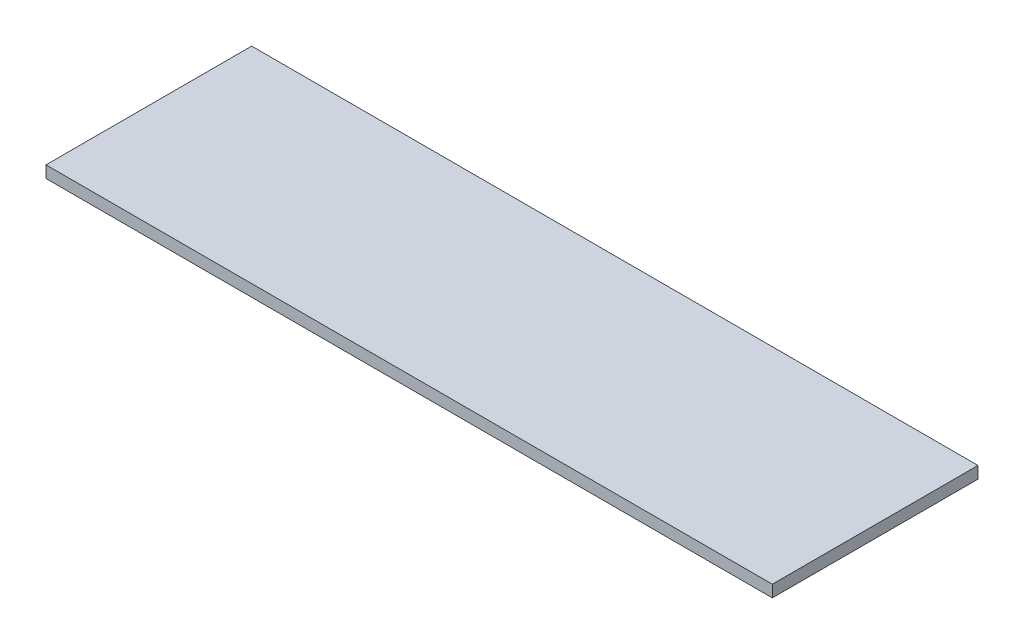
ISO-10303-21;
HEADER;
FILE_DESCRIPTION(('STEP AP214'),'2;1');
FILE_NAME('part.step','',(''),(''),'','','');
FILE_SCHEMA(('AUTOMOTIVE_DESIGN { 1 0 10303 214 1 1 1 1 }'));
ENDSEC;
DATA;
#1=APPLICATION_CONTEXT('core data for automotive mechanical design processes');
#2=APPLICATION_PROTOCOL_DEFINITION('international standard','automotive_design',2000,#1);
#3=PRODUCT_CONTEXT('',#1,'mechanical');
#4=PRODUCT('Part','Part','',(#3));
#5=PRODUCT_RELATED_PRODUCT_CATEGORY('part','',(#4));
#6=PRODUCT_DEFINITION_FORMATION('','',#4);
#7=PRODUCT_DEFINITION_CONTEXT('part definition',#1,'design');
#8=PRODUCT_DEFINITION('design','',#6,#7);
#9=PRODUCT_DEFINITION_SHAPE('','',#8);
#10=(LENGTH_UNIT() NAMED_UNIT(*) SI_UNIT(.MILLI.,.METRE.));
#11=(NAMED_UNIT(*) PLANE_ANGLE_UNIT() SI_UNIT($,.RADIAN.));
#12=(NAMED_UNIT(*) SI_UNIT($,.STERADIAN.) SOLID_ANGLE_UNIT());
#13=UNCERTAINTY_MEASURE_WITH_UNIT(LENGTH_MEASURE(1.E-05),#10,'distance_accuracy_value','');
#14=(GEOMETRIC_REPRESENTATION_CONTEXT(3) GLOBAL_UNCERTAINTY_ASSIGNED_CONTEXT((#13)) GLOBAL_UNIT_ASSIGNED_CONTEXT((#10,
#11,#12)) REPRESENTATION_CONTEXT('',''));
#15=CARTESIAN_POINT('',(0.,0.,0.));
#16=DIRECTION('',(0.,0.,1.));
#17=DIRECTION('',(1.,0.,0.));
#18=AXIS2_PLACEMENT_3D('',#15,#16,#17);
#19=CARTESIAN_POINT('',(111.610966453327,94.,63.5));
#20=DIRECTION('',(-1.,0.,0.));
#21=DIRECTION('',(0.,0.,1.));
#22=AXIS2_PLACEMENT_3D('',#19,#20,#21);
#23=PLANE('',#22);
#24=DIRECTION('',(0.,0.,1.));
#25=VECTOR('',#24,1.);
#26=CARTESIAN_POINT('',(111.610966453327,97.,63.5));
#27=LINE('',#26,#25);
#28=CARTESIAN_POINT('',(111.610966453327,97.,63.5));
#29=VERTEX_POINT('',#28);
#30=CARTESIAN_POINT('',(111.610966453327,97.,115.5));
#31=VERTEX_POINT('',#30);
#32=EDGE_CURVE('E87',#29,#31,#27,.T.);
#33=ORIENTED_EDGE('',*,*,#32,.T.);
#34=DIRECTION('',(0.,1.,0.));
#35=VECTOR('',#34,1.);
#36=CARTESIAN_POINT('',(111.610966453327,94.,115.5));
#37=LINE('',#36,#35);
#38=CARTESIAN_POINT('',(111.610966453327,94.,115.5));
#39=VERTEX_POINT('',#38);
#40=EDGE_CURVE('E41',#39,#31,#37,.T.);
#41=ORIENTED_EDGE('',*,*,#40,.F.);
#42=DIRECTION('',(0.,0.,1.));
#43=VECTOR('',#42,1.);
#44=CARTESIAN_POINT('',(111.610966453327,94.,63.5));
#45=LINE('',#44,#43);
#46=CARTESIAN_POINT('',(111.610966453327,94.,63.5));
#47=VERTEX_POINT('',#46);
#48=EDGE_CURVE('E81',#47,#39,#45,.T.);
#49=ORIENTED_EDGE('',*,*,#48,.F.);
#50=DIRECTION('',(0.,1.,0.));
#51=VECTOR('',#50,1.);
#52=CARTESIAN_POINT('',(111.610966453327,94.,63.5));
#53=LINE('',#52,#51);
#54=EDGE_CURVE('E11',#47,#29,#53,.T.);
#55=ORIENTED_EDGE('',*,*,#54,.T.);
#56=EDGE_LOOP('',(#33,#41,#49,#55));
#57=FACE_BOUND('',#56,.T.);
#58=ADVANCED_FACE('F33',(#57),#23,.F.);
#59=CARTESIAN_POINT('',(111.610966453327,94.,115.5));
#60=DIRECTION('',(0.,0.,-1.));
#61=DIRECTION('',(-1.,0.,0.));
#62=AXIS2_PLACEMENT_3D('',#59,#60,#61);
#63=PLANE('',#62);
#64=DIRECTION('',(-1.,0.,0.));
#65=VECTOR('',#64,1.);
#66=CARTESIAN_POINT('',(111.610966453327,97.,115.5));
#67=LINE('',#66,#65);
#68=CARTESIAN_POINT('',(-72.0156283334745,97.,115.5));
#69=VERTEX_POINT('',#68);
#70=EDGE_CURVE('E67',#31,#69,#67,.T.);
#71=ORIENTED_EDGE('',*,*,#70,.T.);
#72=DIRECTION('',(0.,1.,0.));
#73=VECTOR('',#72,1.);
#74=CARTESIAN_POINT('',(-72.0156283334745,94.,115.5));
#75=LINE('',#74,#73);
#76=CARTESIAN_POINT('',(-72.0156283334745,94.,115.5));
#77=VERTEX_POINT('',#76);
#78=EDGE_CURVE('E88',#77,#69,#75,.T.);
#79=ORIENTED_EDGE('',*,*,#78,.F.);
#80=DIRECTION('',(-1.,0.,0.));
#81=VECTOR('',#80,1.);
#82=CARTESIAN_POINT('',(111.610966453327,94.,115.5));
#83=LINE('',#82,#81);
#84=EDGE_CURVE('E85',#39,#77,#83,.T.);
#85=ORIENTED_EDGE('',*,*,#84,.F.);
#86=ORIENTED_EDGE('',*,*,#40,.T.);
#87=EDGE_LOOP('',(#71,#79,#85,#86));
#88=FACE_BOUND('',#87,.T.);
#89=ADVANCED_FACE('F89',(#88),#63,.F.);
#90=CARTESIAN_POINT('',(-72.0156283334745,94.,63.5));
#91=DIRECTION('',(1.,0.,0.));
#92=DIRECTION('',(0.,0.,-1.));
#93=AXIS2_PLACEMENT_3D('',#90,#91,#92);
#94=PLANE('',#93);
#95=DIRECTION('',(0.,0.,-1.));
#96=VECTOR('',#95,1.);
#97=CARTESIAN_POINT('',(-72.0156283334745,97.,63.5));
#98=LINE('',#97,#96);
#99=CARTESIAN_POINT('',(-72.0156283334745,97.,63.5));
#100=VERTEX_POINT('',#99);
#101=EDGE_CURVE('E99',#69,#100,#98,.T.);
#102=ORIENTED_EDGE('',*,*,#101,.T.);
#103=DIRECTION('',(0.,1.,0.));
#104=VECTOR('',#103,1.);
#105=CARTESIAN_POINT('',(-72.0156283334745,94.,63.5));
#106=LINE('',#105,#104);
#107=CARTESIAN_POINT('',(-72.0156283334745,94.,63.5));
#108=VERTEX_POINT('',#107);
#109=EDGE_CURVE('E93',#108,#100,#106,.T.);
#110=ORIENTED_EDGE('',*,*,#109,.F.);
#111=DIRECTION('',(0.,0.,-1.));
#112=VECTOR('',#111,1.);
#113=CARTESIAN_POINT('',(-72.0156283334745,94.,63.5));
#114=LINE('',#113,#112);
#115=EDGE_CURVE('E91',#77,#108,#114,.T.);
#116=ORIENTED_EDGE('',*,*,#115,.F.);
#117=ORIENTED_EDGE('',*,*,#78,.T.);
#118=EDGE_LOOP('',(#102,#110,#116,#117));
#119=FACE_BOUND('',#118,.T.);
#120=ADVANCED_FACE('F104',(#119),#94,.F.);
#121=CARTESIAN_POINT('',(97.5,94.,63.5));
#122=DIRECTION('',(0.,0.,1.));
#123=DIRECTION('',(1.,0.,0.));
#124=AXIS2_PLACEMENT_3D('',#121,#122,#123);
#125=PLANE('',#124);
#126=DIRECTION('',(1.,0.,0.));
#127=VECTOR('',#126,1.);
#128=CARTESIAN_POINT('',(97.5,97.,63.5));
#129=LINE('',#128,#127);
#130=EDGE_CURVE('E74',#100,#29,#129,.T.);
#131=ORIENTED_EDGE('',*,*,#130,.T.);
#132=ORIENTED_EDGE('',*,*,#54,.F.);
#133=DIRECTION('',(1.,0.,0.));
#134=VECTOR('',#133,1.);
#135=CARTESIAN_POINT('',(97.5,94.,63.5));
#136=LINE('',#135,#134);
#137=EDGE_CURVE('E49',#108,#47,#136,.T.);
#138=ORIENTED_EDGE('',*,*,#137,.F.);
#139=ORIENTED_EDGE('',*,*,#109,.T.);
#140=EDGE_LOOP('',(#131,#132,#138,#139));
#141=FACE_BOUND('',#140,.T.);
#142=ADVANCED_FACE('F107',(#141),#125,.F.);
#143=CARTESIAN_POINT('',(0.,94.,0.));
#144=DIRECTION('',(0.,-1.,0.));
#145=DIRECTION('',(0.,0.,-1.));
#146=AXIS2_PLACEMENT_3D('',#143,#144,#145);
#147=PLANE('',#146);
#148=ORIENTED_EDGE('',*,*,#137,.T.);
#149=ORIENTED_EDGE('',*,*,#48,.T.);
#150=ORIENTED_EDGE('',*,*,#84,.T.);
#151=ORIENTED_EDGE('',*,*,#115,.T.);
#152=EDGE_LOOP('',(#148,#149,#150,#151));
#153=FACE_BOUND('',#152,.T.);
#154=ADVANCED_FACE('F83',(#153),#147,.T.);
#155=CARTESIAN_POINT('',(0.,97.,0.));
#156=DIRECTION('',(0.,-1.,0.));
#157=DIRECTION('',(0.,0.,-1.));
#158=AXIS2_PLACEMENT_3D('',#155,#156,#157);
#159=PLANE('',#158);
#160=ORIENTED_EDGE('',*,*,#32,.F.);
#161=ORIENTED_EDGE('',*,*,#130,.F.);
#162=ORIENTED_EDGE('',*,*,#101,.F.);
#163=ORIENTED_EDGE('',*,*,#70,.F.);
#164=EDGE_LOOP('',(#160,#161,#162,#163));
#165=FACE_BOUND('',#164,.T.);
#166=ADVANCED_FACE('F106',(#165),#159,.F.);
#167=CLOSED_SHELL('',(#58,#89,#120,#142,#154,#166));
#168=MANIFOLD_SOLID_BREP('B2',#167);
#169=ADVANCED_BREP_SHAPE_REPRESENTATION('',(#18,#168),#14);
#170=SHAPE_DEFINITION_REPRESENTATION(#9,#169);
ENDSEC;
END-ISO-10303-21;
